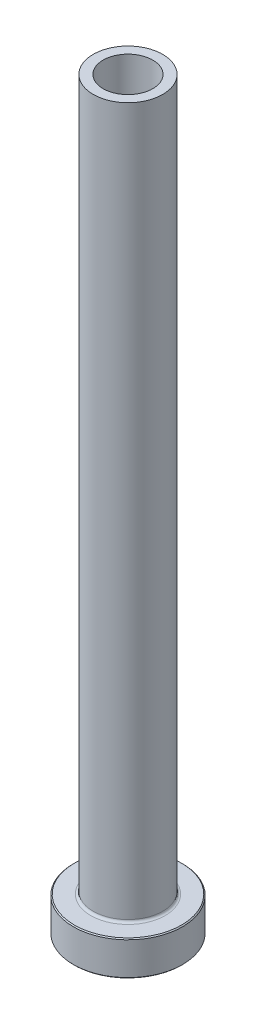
from build123d import *

# Parameters (mm, degrees)
FILLET1_R     = 0.5
CHAMFER1_SIZE = 0.2
CHAMFER3_SIZE = 0.5


with BuildPart() as part:
    # Sketch1 → Revolve1 (revolve)
    with BuildSketch(Plane.XY, mode=Mode.PRIVATE) as revolve1_sk:
        Polygon((-5, 150), (-7, 150), (-7, 7), (-11, 7), (-11, 0), (-5.25, 0), (-5.25, 93), (-5, 105), align=None)
    revolve(revolve1_sk.sketch.rotate(Axis((0, 92.187680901, 0), (0, -1, 0)), 270), axis=Axis((0, 92.187680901, 0), (0, -1, 0)))

    # Fillet1
    fillet1_edges = [part.edges().sort_by_distance(p)[0] for p in [
        (0, 7, -7),
    ]]
    fillet(fillet1_edges, radius=FILLET1_R)

    # Chamfer1
    chamfer1_edges = [part.edges().sort_by_distance(p)[0] for p in [
        (0, 0, -11),
        (0, 7, -11),
    ]]
    chamfer(chamfer1_edges, length=CHAMFER1_SIZE)

    # Chamfer3
    chamfer3_edges = [part.edges().sort_by_distance(p)[0] for p in [
        (0, 0, -5.25),
    ]]
    chamfer(chamfer3_edges, length=CHAMFER3_SIZE)


solid = part.part
